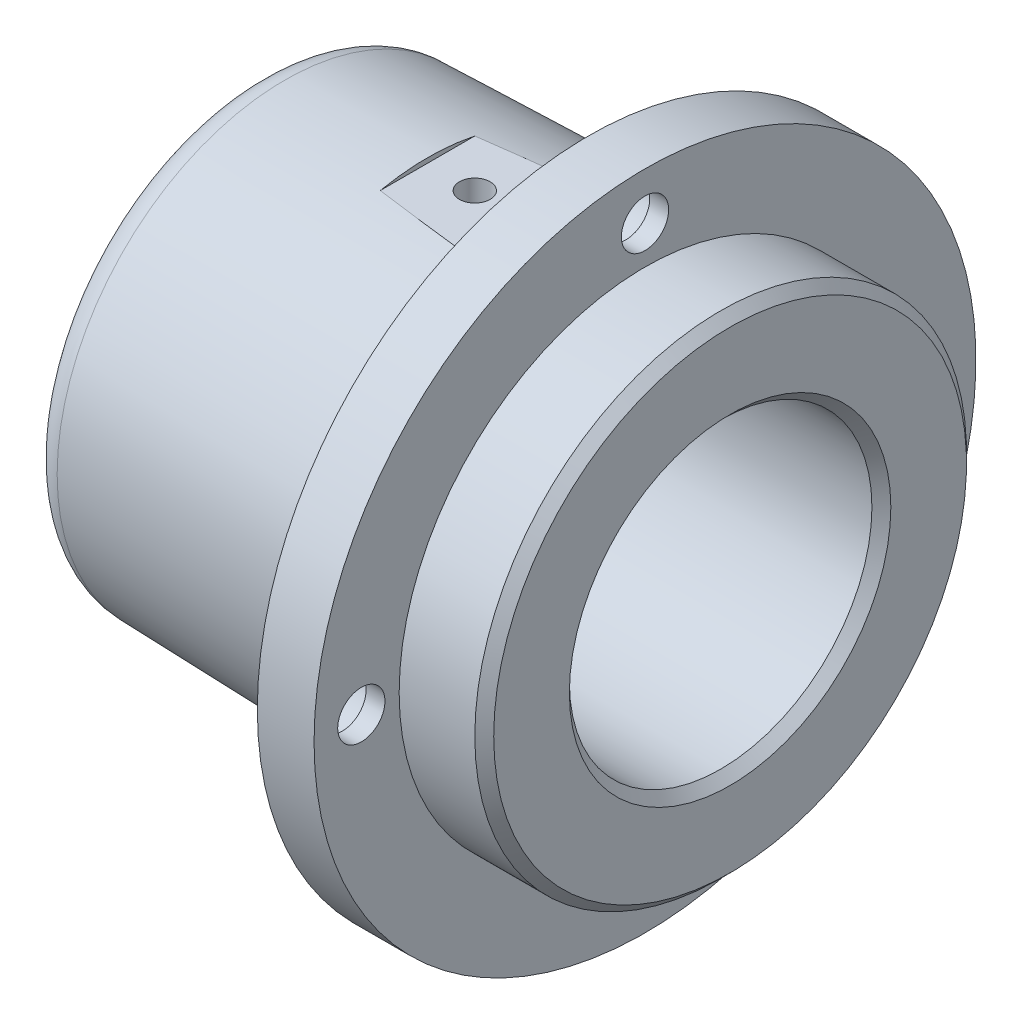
ISO-10303-21;
HEADER;
FILE_DESCRIPTION(('STEP AP214'),'2;1');
FILE_NAME('part.step','',(''),(''),'','','');
FILE_SCHEMA(('AUTOMOTIVE_DESIGN { 1 0 10303 214 1 1 1 1 }'));
ENDSEC;
DATA;
#1=APPLICATION_CONTEXT('core data for automotive mechanical design processes');
#2=APPLICATION_PROTOCOL_DEFINITION('international standard','automotive_design',2000,#1);
#3=PRODUCT_CONTEXT('',#1,'mechanical');
#4=PRODUCT('Part','Part','',(#3));
#5=PRODUCT_RELATED_PRODUCT_CATEGORY('part','',(#4));
#6=PRODUCT_DEFINITION_FORMATION('','',#4);
#7=PRODUCT_DEFINITION_CONTEXT('part definition',#1,'design');
#8=PRODUCT_DEFINITION('design','',#6,#7);
#9=PRODUCT_DEFINITION_SHAPE('','',#8);
#10=(LENGTH_UNIT() NAMED_UNIT(*) SI_UNIT(.MILLI.,.METRE.));
#11=(NAMED_UNIT(*) PLANE_ANGLE_UNIT() SI_UNIT($,.RADIAN.));
#12=(NAMED_UNIT(*) SI_UNIT($,.STERADIAN.) SOLID_ANGLE_UNIT());
#13=UNCERTAINTY_MEASURE_WITH_UNIT(LENGTH_MEASURE(1.E-05),#10,'distance_accuracy_value','');
#14=(GEOMETRIC_REPRESENTATION_CONTEXT(3) GLOBAL_UNCERTAINTY_ASSIGNED_CONTEXT((#13)) GLOBAL_UNIT_ASSIGNED_CONTEXT((#10,
#11,#12)) REPRESENTATION_CONTEXT('',''));
#15=CARTESIAN_POINT('',(0.,0.,0.));
#16=DIRECTION('',(0.,0.,1.));
#17=DIRECTION('',(1.,0.,0.));
#18=AXIS2_PLACEMENT_3D('',#15,#16,#17);
#19=CARTESIAN_POINT('',(35.,0.,0.));
#20=DIRECTION('',(1.,0.,0.));
#21=DIRECTION('',(0.,0.,-1.));
#22=AXIS2_PLACEMENT_3D('',#19,#20,#21);
#23=CONICAL_SURFACE('',#22,25.,0.0285636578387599);
#24=CARTESIAN_POINT('',(28.,0.,0.));
#25=DIRECTION('',(1.,0.,0.));
#26=DIRECTION('',(0.,0.,-1.));
#27=AXIS2_PLACEMENT_3D('',#24,#25,#26);
#28=CIRCLE('',#27,24.8);
#29=CARTESIAN_POINT('',(28.,24.,-6.24819974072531));
#30=VERTEX_POINT('',#29);
#31=CARTESIAN_POINT('',(28.,24.,6.24819974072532));
#32=VERTEX_POINT('',#31);
#33=EDGE_CURVE('E63',#30,#32,#28,.T.);
#34=ORIENTED_EDGE('',*,*,#33,.T.);
#35=CARTESIAN_POINT('',(58.5616580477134,24.,9.11661650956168));
#36=CARTESIAN_POINT('',(56.5215289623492,24.,8.95238405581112));
#37=CARTESIAN_POINT('',(54.4816889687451,24.,8.78446156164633));
#38=CARTESIAN_POINT('',(50.4026138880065,24.,8.43944149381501));
#39=CARTESIAN_POINT('',(48.3633788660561,24.,8.2623431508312));
#40=CARTESIAN_POINT('',(44.2799830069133,24.,7.89667501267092));
#41=CARTESIAN_POINT('',(42.2358249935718,24.,7.70807350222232));
#42=CARTESIAN_POINT('',(38.1489495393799,24.,7.31719920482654));
#43=CARTESIAN_POINT('',(36.1062320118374,24.,7.11492732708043));
#44=CARTESIAN_POINT('',(31.9600617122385,24.,6.68645781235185));
#45=CARTESIAN_POINT('',(29.8566643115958,24.,6.45971723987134));
#46=CARTESIAN_POINT('',(26.7035139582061,24.,6.10060335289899));
#47=CARTESIAN_POINT('',(25.6526802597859,24.,5.97771794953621));
#48=CARTESIAN_POINT('',(23.5519411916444,24.,5.72431825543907));
#49=CARTESIAN_POINT('',(22.5020358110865,24.,5.59380405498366));
#50=CARTESIAN_POINT('',(20.4049789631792,24.,5.32364431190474));
#51=CARTESIAN_POINT('',(19.3578257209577,24.,5.18401260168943));
#52=CARTESIAN_POINT('',(17.2650845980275,24.,4.8930057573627));
#53=CARTESIAN_POINT('',(16.2194967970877,24.,4.74163004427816));
#54=CARTESIAN_POINT('',(14.1310256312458,24.,4.42347278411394));
#55=CARTESIAN_POINT('',(13.0881414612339,24.,4.25669654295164));
#56=CARTESIAN_POINT('',(11.0060371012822,24.,3.90178317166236));
#57=CARTESIAN_POINT('',(9.96681649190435,24.,3.71364857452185));
#58=CARTESIAN_POINT('',(8.67481414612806,24.,3.45843101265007));
#59=CARTESIAN_POINT('',(8.41896769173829,24.,3.40684439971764));
#60=CARTESIAN_POINT('',(7.90775490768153,24.,3.30131997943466));
#61=CARTESIAN_POINT('',(7.65238858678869,24.,3.24738212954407));
#62=CARTESIAN_POINT('',(6.88696486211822,24.,3.08151823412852));
#63=CARTESIAN_POINT('',(6.37776930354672,24.,2.96557820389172));
#64=CARTESIAN_POINT('',(5.36479793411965,24.,2.71955545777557));
#65=CARTESIAN_POINT('',(4.86100879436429,24.,2.58952901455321));
#66=CARTESIAN_POINT('',(4.11006629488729,24.,2.37808316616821));
#67=CARTESIAN_POINT('',(3.8606041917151,24.,2.30488722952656));
#68=CARTESIAN_POINT('',(3.36388972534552,24.,2.1513849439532));
#69=CARTESIAN_POINT('',(3.11663702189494,24.,2.07107971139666));
#70=CARTESIAN_POINT('',(2.62024507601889,24.,1.8990988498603));
#71=CARTESIAN_POINT('',(2.37117633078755,24.,1.80721884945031));
#72=CARTESIAN_POINT('',(1.87843694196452,24.,1.6090400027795));
#73=CARTESIAN_POINT('',(1.63476900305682,24.,1.50273411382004));
#74=CARTESIAN_POINT('',(1.25453834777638,24.,1.31402768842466));
#75=CARTESIAN_POINT('',(1.11425718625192,24.,1.23916901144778));
#76=CARTESIAN_POINT('',(0.8409028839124,24.,1.07726028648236));
#77=CARTESIAN_POINT('',(0.707815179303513,24.,0.990236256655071));
#78=CARTESIAN_POINT('',(0.523284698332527,24.,0.848441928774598));
#79=CARTESIAN_POINT('',(0.466121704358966,24.,0.801190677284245));
#80=CARTESIAN_POINT('',(0.356614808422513,24.,0.701207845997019));
#81=CARTESIAN_POINT('',(0.304273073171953,24.,0.648473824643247));
#82=CARTESIAN_POINT('',(0.216510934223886,24.,0.546838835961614));
#83=CARTESIAN_POINT('',(0.179763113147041,24.,0.499102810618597));
#84=CARTESIAN_POINT('',(0.113986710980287,24.,0.398552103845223));
#85=CARTESIAN_POINT('',(0.0849369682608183,24.,0.345751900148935));
#86=CARTESIAN_POINT('',(0.0454239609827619,24.,0.252472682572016));
#87=CARTESIAN_POINT('',(0.0319900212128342,24.,0.213268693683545));
#88=CARTESIAN_POINT('',(0.0117704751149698,24.,0.13318530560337));
#89=CARTESIAN_POINT('',(0.00497561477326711,24.,0.0923083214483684));
#90=CARTESIAN_POINT('',(-0.00117529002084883,24.,0.00978855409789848));
#91=CARTESIAN_POINT('',(-0.000496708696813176,24.,-0.031856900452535));
#92=CARTESIAN_POINT('',(0.00829147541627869,24.,-0.11436208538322));
#93=CARTESIAN_POINT('',(0.0164077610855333,24.,-0.155221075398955));
#94=CARTESIAN_POINT('',(0.0416129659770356,24.,-0.243806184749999));
#95=CARTESIAN_POINT('',(0.0602780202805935,24.,-0.291075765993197));
#96=CARTESIAN_POINT('',(0.104891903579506,24.,-0.382021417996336));
#97=CARTESIAN_POINT('',(0.130856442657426,24.,-0.42568947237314));
#98=CARTESIAN_POINT('',(0.208617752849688,24.,-0.539798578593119));
#99=CARTESIAN_POINT('',(0.26550211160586,24.,-0.606718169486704));
#100=CARTESIAN_POINT('',(0.387853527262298,24.,-0.732090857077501));
#101=CARTESIAN_POINT('',(0.453347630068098,24.,-0.790515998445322));
#102=CARTESIAN_POINT('',(0.629426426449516,24.,-0.933415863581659));
#103=CARTESIAN_POINT('',(0.743900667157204,24.,-1.01303496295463));
#104=CARTESIAN_POINT('',(0.979584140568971,24.,-1.16175171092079));
#105=CARTESIAN_POINT('',(1.1008095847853,24.,-1.23082239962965));
#106=CARTESIAN_POINT('',(1.34796159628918,24.,-1.36176794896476));
#107=CARTESIAN_POINT('',(1.47391145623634,24.,-1.42359849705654));
#108=CARTESIAN_POINT('',(1.72826487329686,24.,-1.54144498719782));
#109=CARTESIAN_POINT('',(1.85666506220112,24.,-1.59746831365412));
#110=CARTESIAN_POINT('',(2.28452915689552,24.,-1.77563893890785));
#111=CARTESIAN_POINT('',(2.58790518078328,24.,-1.88834809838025));
#112=CARTESIAN_POINT('',(3.19967309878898,24.,-2.09936350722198));
#113=CARTESIAN_POINT('',(3.50806836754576,24.,-2.19765958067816));
#114=CARTESIAN_POINT('',(4.12859015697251,24.,-2.38424727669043));
#115=CARTESIAN_POINT('',(4.44072334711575,24.,-2.47251661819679));
#116=CARTESIAN_POINT('',(5.06706129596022,24.,-2.6414143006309));
#117=CARTESIAN_POINT('',(5.38126628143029,24.,-2.72204178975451));
#118=CARTESIAN_POINT('',(6.32567455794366,24.,-2.95497228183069));
#119=CARTESIAN_POINT('',(6.95805333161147,24.,-3.09843290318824));
#120=CARTESIAN_POINT('',(8.2252080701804,24.,-3.36946525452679));
#121=CARTESIAN_POINT('',(8.85997949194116,24.,-3.49705875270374));
#122=CARTESIAN_POINT('',(10.1265756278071,24.,-3.73976970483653));
#123=CARTESIAN_POINT('',(10.7583827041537,24.,-3.85497964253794));
#124=CARTESIAN_POINT('',(12.0235261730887,24.,-4.07667892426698));
#125=CARTESIAN_POINT('',(12.6568625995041,24.,-4.18316807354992));
#126=CARTESIAN_POINT('',(14.5587007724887,24.,-4.49229352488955));
#127=CARTESIAN_POINT('',(15.8288855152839,24.,-4.68456083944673));
#128=CARTESIAN_POINT('',(18.3731239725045,24.,-5.05022964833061));
#129=CARTESIAN_POINT('',(19.6471801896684,24.,-5.22361339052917));
#130=CARTESIAN_POINT('',(22.1970631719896,24.,-5.55609537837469));
#131=CARTESIAN_POINT('',(23.4728898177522,24.,-5.71519454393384));
#132=CARTESIAN_POINT('',(26.0243091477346,24.,-6.02208468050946));
#133=CARTESIAN_POINT('',(27.2999002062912,24.,-6.16988925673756));
#134=CARTESIAN_POINT('',(29.8521066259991,24.,-6.45651957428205));
#135=CARTESIAN_POINT('',(31.1287220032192,24.,-6.59534517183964));
#136=CARTESIAN_POINT('',(34.9587791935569,24.,-7.00065470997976));
#137=CARTESIAN_POINT('',(37.5133917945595,24.,-7.25608418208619));
#138=CARTESIAN_POINT('',(41.6088482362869,24.,-7.64829338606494));
#139=CARTESIAN_POINT('',(43.1490524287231,24.,-7.79187959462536));
#140=CARTESIAN_POINT('',(46.2302159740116,24.,-8.07241725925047));
#141=CARTESIAN_POINT('',(47.771175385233,24.,-8.20936807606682));
#142=CARTESIAN_POINT('',(50.8535636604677,24.,-8.47756833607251));
#143=CARTESIAN_POINT('',(52.3949925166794,24.,-8.60881786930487));
#144=CARTESIAN_POINT('',(55.4781098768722,24.,-8.86630100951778));
#145=CARTESIAN_POINT('',(57.0197983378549,24.,-8.99253513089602));
#146=CARTESIAN_POINT('',(58.5616580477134,24.,-9.11661650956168));
#147=B_SPLINE_CURVE_WITH_KNOTS('',3,(#35,#36,#37,#38,#39,#40,#41,#42,#43,#44,#45,#46,#47,#48,
#49,#50,#51,#52,#53,#54,#55,#56,#57,#58,#59,#60,#61,#62,#63,#64,#65,#66,#67,#68,#69,#70,#71,#72,
#73,#74,#75,#76,#77,#78,#79,#80,#81,#82,#83,#84,#85,#86,#87,#88,#89,#90,#91,#92,#93,#94,#95,#96,
#97,#98,#99,#100,#101,#102,#103,#104,#105,#106,#107,#108,#109,#110,#111,#112,#113,#114,#115,
#116,#117,#118,#119,#120,#121,#122,#123,#124,#125,#126,#127,#128,#129,#130,#131,#132,#133,#134,
#135,#136,#137,#138,#139,#140,#141,#142,#143,#144,#145,#146),.UNSPECIFIED.,.F.,.F.,(4,2,2,2,2,2,
2,2,2,2,2,2,2,2,2,2,2,2,2,2,2,2,2,2,2,2,2,2,2,2,2,2,2,2,2,2,2,2,2,2,2,2,2,2,2,2,2,2,2,2,2,2,2,2,
2,4),(0.,6.14019483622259,12.2809053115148,18.4393870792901,24.597459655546,30.9440794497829,
34.1180416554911,37.2919663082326,40.4611828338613,43.6305556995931,46.7988406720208,
49.9667502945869,50.7497273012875,51.5327184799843,53.0992710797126,54.659781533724,
55.4396463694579,56.2193889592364,57.0156045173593,57.8122101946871,58.2889383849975,
58.7646621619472,58.9869217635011,59.2092807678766,59.3895356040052,59.5692896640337,
59.6931399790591,59.8168174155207,59.9410681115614,60.0654305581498,60.2170374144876,
60.3689730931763,60.6309742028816,60.8938189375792,61.3110476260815,61.7293254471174,
62.1500425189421,62.5702178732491,63.5404002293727,64.5112642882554,65.4842452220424,
66.4573344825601,68.4023211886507,70.344609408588,72.2712025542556,74.197838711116,
78.0515560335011,81.9088654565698,85.765926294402,89.6182652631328,93.4706658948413,
101.172568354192,105.813207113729,110.45429206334,115.09530368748,119.735838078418),.UNSPECIFIED.);
#148=CARTESIAN_POINT('',(18.,24.,4.99501792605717));
#149=VERTEX_POINT('',#148);
#150=EDGE_CURVE('E11',#32,#149,#147,.T.);
#151=ORIENTED_EDGE('',*,*,#150,.T.);
#152=CARTESIAN_POINT('',(18.,0.,0.));
#153=DIRECTION('',(-1.,0.,0.));
#154=DIRECTION('',(0.,0.,1.));
#155=AXIS2_PLACEMENT_3D('',#152,#153,#154);
#156=CIRCLE('',#155,24.5142857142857);
#157=CARTESIAN_POINT('',(18.,24.,-4.99501792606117));
#158=VERTEX_POINT('',#157);
#159=EDGE_CURVE('E35',#149,#158,#156,.T.);
#160=ORIENTED_EDGE('',*,*,#159,.T.);
#161=EDGE_CURVE('E41',#158,#30,#147,.T.);
#162=ORIENTED_EDGE('',*,*,#161,.T.);
#163=EDGE_LOOP('',(#34,#151,#160,#162));
#164=FACE_BOUND('',#163,.T.);
#165=CARTESIAN_POINT('',(34.0285597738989,0.,0.));
#166=DIRECTION('',(1.,0.,0.));
#167=DIRECTION('',(0.,0.,-1.));
#168=AXIS2_PLACEMENT_3D('',#165,#166,#167);
#169=CIRCLE('',#168,24.9722445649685);
#170=CARTESIAN_POINT('',(34.0285597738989,0.,-24.9722445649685));
#171=VERTEX_POINT('',#170);
#172=EDGE_CURVE('E219',#171,#171,#169,.F.);
#173=ORIENTED_EDGE('',*,*,#172,.T.);
#174=EDGE_LOOP('',(#173));
#175=FACE_BOUND('',#174,.T.);
#176=CARTESIAN_POINT('',(2.91432067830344,0.,0.));
#177=DIRECTION('',(-1.,0.,0.));
#178=DIRECTION('',(0.,0.,1.));
#179=AXIS2_PLACEMENT_3D('',#176,#177,#178);
#180=CIRCLE('',#179,24.0832663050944);
#181=CARTESIAN_POINT('',(2.91432067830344,0.,24.0832663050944));
#182=VERTEX_POINT('',#181);
#183=EDGE_CURVE('E210',#182,#182,#180,.F.);
#184=ORIENTED_EDGE('',*,*,#183,.T.);
#185=EDGE_LOOP('',(#184));
#186=FACE_BOUND('',#185,.T.);
#187=ADVANCED_FACE('F31',(#164,#175,#186),#23,.T.);
#188=CARTESIAN_POINT('',(35.,25.,0.));
#189=DIRECTION('',(1.,0.,0.));
#190=DIRECTION('',(0.,0.,-1.));
#191=AXIS2_PLACEMENT_3D('',#188,#189,#190);
#192=PLANE('',#191);
#193=CARTESIAN_POINT('',(35.,3.14233502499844E-13,-30.));
#194=DIRECTION('',(-1.,0.,0.));
#195=DIRECTION('',(0.,1.,0.));
#196=AXIS2_PLACEMENT_3D('',#193,#194,#195);
#197=CIRCLE('',#196,4.);
#198=CARTESIAN_POINT('',(35.,4.00000000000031,-30.));
#199=VERTEX_POINT('',#198);
#200=EDGE_CURVE('E186',#199,#199,#197,.T.);
#201=ORIENTED_EDGE('',*,*,#200,.F.);
#202=EDGE_LOOP('',(#201));
#203=FACE_BOUND('',#202,.T.);
#204=CARTESIAN_POINT('',(35.,-30.,-2.09489001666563E-13));
#205=DIRECTION('',(-1.,0.,0.));
#206=DIRECTION('',(0.,0.,-1.));
#207=AXIS2_PLACEMENT_3D('',#204,#205,#206);
#208=CIRCLE('',#207,4.);
#209=CARTESIAN_POINT('',(35.,-30.,-4.00000000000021));
#210=VERTEX_POINT('',#209);
#211=EDGE_CURVE('E190',#210,#210,#208,.T.);
#212=ORIENTED_EDGE('',*,*,#211,.F.);
#213=EDGE_LOOP('',(#212));
#214=FACE_BOUND('',#213,.T.);
#215=CARTESIAN_POINT('',(35.,-1.04744500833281E-13,30.));
#216=DIRECTION('',(-1.,0.,0.));
#217=DIRECTION('',(0.,-1.,0.));
#218=AXIS2_PLACEMENT_3D('',#215,#216,#217);
#219=CIRCLE('',#218,4.);
#220=CARTESIAN_POINT('',(35.,-4.0000000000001,30.));
#221=VERTEX_POINT('',#220);
#222=EDGE_CURVE('E194',#221,#221,#219,.T.);
#223=ORIENTED_EDGE('',*,*,#222,.F.);
#224=EDGE_LOOP('',(#223));
#225=FACE_BOUND('',#224,.T.);
#226=CARTESIAN_POINT('',(35.,30.,0.));
#227=DIRECTION('',(-1.,0.,0.));
#228=DIRECTION('',(0.,0.,1.));
#229=AXIS2_PLACEMENT_3D('',#226,#227,#228);
#230=CIRCLE('',#229,4.);
#231=CARTESIAN_POINT('',(35.,30.,4.));
#232=VERTEX_POINT('',#231);
#233=EDGE_CURVE('E198',#232,#232,#230,.T.);
#234=ORIENTED_EDGE('',*,*,#233,.F.);
#235=EDGE_LOOP('',(#234));
#236=FACE_BOUND('',#235,.T.);
#237=CARTESIAN_POINT('',(35.,0.,0.));
#238=DIRECTION('',(1.,0.,0.));
#239=DIRECTION('',(0.,0.,-1.));
#240=AXIS2_PLACEMENT_3D('',#237,#238,#239);
#241=CIRCLE('',#240,25.9718366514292);
#242=CARTESIAN_POINT('',(35.,0.,-25.9718366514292));
#243=VERTEX_POINT('',#242);
#244=EDGE_CURVE('E202',#243,#243,#241,.T.);
#245=ORIENTED_EDGE('',*,*,#244,.T.);
#246=EDGE_LOOP('',(#245));
#247=FACE_BOUND('',#246,.T.);
#248=CARTESIAN_POINT('',(35.,0.,0.));
#249=DIRECTION('',(-1.,0.,0.));
#250=DIRECTION('',(0.,0.,1.));
#251=AXIS2_PLACEMENT_3D('',#248,#249,#250);
#252=CIRCLE('',#251,35.);
#253=CARTESIAN_POINT('',(35.,0.,35.));
#254=VERTEX_POINT('',#253);
#255=EDGE_CURVE('E205',#254,#254,#252,.T.);
#256=ORIENTED_EDGE('',*,*,#255,.T.);
#257=EDGE_LOOP('',(#256));
#258=FACE_BOUND('',#257,.T.);
#259=ADVANCED_FACE('F176',(#203,#214,#225,#236,#247,#258),#192,.F.);
#260=CARTESIAN_POINT('',(-12.3083700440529,0.,0.));
#261=DIRECTION('',(-1.,0.,0.));
#262=DIRECTION('',(0.,0.,1.));
#263=AXIS2_PLACEMENT_3D('',#260,#261,#262);
#264=CYLINDRICAL_SURFACE('',#263,35.);
#265=ORIENTED_EDGE('',*,*,#255,.F.);
#266=EDGE_LOOP('',(#265));
#267=FACE_BOUND('',#266,.T.);
#268=CARTESIAN_POINT('',(41.,0.,0.));
#269=DIRECTION('',(-1.,0.,0.));
#270=DIRECTION('',(0.,0.,1.));
#271=AXIS2_PLACEMENT_3D('',#268,#269,#270);
#272=CIRCLE('',#271,35.);
#273=CARTESIAN_POINT('',(41.,0.,35.));
#274=VERTEX_POINT('',#273);
#275=EDGE_CURVE('E207',#274,#274,#272,.T.);
#276=ORIENTED_EDGE('',*,*,#275,.T.);
#277=EDGE_LOOP('',(#276));
#278=FACE_BOUND('',#277,.T.);
#279=ADVANCED_FACE('F173',(#267,#278),#264,.T.);
#280=CARTESIAN_POINT('',(41.,35.,0.));
#281=DIRECTION('',(-1.,0.,0.));
#282=DIRECTION('',(0.,0.,1.));
#283=AXIS2_PLACEMENT_3D('',#280,#281,#282);
#284=PLANE('',#283);
#285=CARTESIAN_POINT('',(41.,3.14233502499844E-13,-30.));
#286=DIRECTION('',(-1.,0.,0.));
#287=DIRECTION('',(0.,0.,1.));
#288=AXIS2_PLACEMENT_3D('',#285,#286,#287);
#289=CIRCLE('',#288,2.5);
#290=CARTESIAN_POINT('',(41.,3.14233502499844E-13,-27.5));
#291=VERTEX_POINT('',#290);
#292=EDGE_CURVE('E291',#291,#291,#289,.T.);
#293=ORIENTED_EDGE('',*,*,#292,.T.);
#294=EDGE_LOOP('',(#293));
#295=FACE_BOUND('',#294,.T.);
#296=CARTESIAN_POINT('',(41.,-30.,-2.09489001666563E-13));
#297=DIRECTION('',(-1.,0.,0.));
#298=DIRECTION('',(0.,0.,1.));
#299=AXIS2_PLACEMENT_3D('',#296,#297,#298);
#300=CIRCLE('',#299,2.5);
#301=CARTESIAN_POINT('',(41.,-30.,2.49999999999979));
#302=VERTEX_POINT('',#301);
#303=EDGE_CURVE('E285',#302,#302,#300,.T.);
#304=ORIENTED_EDGE('',*,*,#303,.T.);
#305=EDGE_LOOP('',(#304));
#306=FACE_BOUND('',#305,.T.);
#307=CARTESIAN_POINT('',(41.,-1.04744500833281E-13,30.));
#308=DIRECTION('',(-1.,0.,0.));
#309=DIRECTION('',(0.,0.,1.));
#310=AXIS2_PLACEMENT_3D('',#307,#308,#309);
#311=CIRCLE('',#310,2.5);
#312=CARTESIAN_POINT('',(41.,-1.04744500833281E-13,32.5));
#313=VERTEX_POINT('',#312);
#314=EDGE_CURVE('E279',#313,#313,#311,.T.);
#315=ORIENTED_EDGE('',*,*,#314,.T.);
#316=EDGE_LOOP('',(#315));
#317=FACE_BOUND('',#316,.T.);
#318=CARTESIAN_POINT('',(41.,30.,0.));
#319=DIRECTION('',(-1.,0.,0.));
#320=DIRECTION('',(0.,0.,1.));
#321=AXIS2_PLACEMENT_3D('',#318,#319,#320);
#322=CIRCLE('',#321,2.5);
#323=CARTESIAN_POINT('',(41.,30.,2.5));
#324=VERTEX_POINT('',#323);
#325=EDGE_CURVE('E261',#324,#324,#322,.T.);
#326=ORIENTED_EDGE('',*,*,#325,.T.);
#327=EDGE_LOOP('',(#326));
#328=FACE_BOUND('',#327,.T.);
#329=ORIENTED_EDGE('',*,*,#275,.F.);
#330=EDGE_LOOP('',(#329));
#331=FACE_BOUND('',#330,.T.);
#332=CARTESIAN_POINT('',(41.,0.,0.));
#333=DIRECTION('',(-1.,0.,0.));
#334=DIRECTION('',(0.,0.,1.));
#335=AXIS2_PLACEMENT_3D('',#332,#333,#334);
#336=CIRCLE('',#335,26.);
#337=CARTESIAN_POINT('',(41.,0.,26.));
#338=VERTEX_POINT('',#337);
#339=EDGE_CURVE('E213',#338,#338,#336,.T.);
#340=ORIENTED_EDGE('',*,*,#339,.T.);
#341=EDGE_LOOP('',(#340));
#342=FACE_BOUND('',#341,.T.);
#343=ADVANCED_FACE('F169',(#295,#306,#317,#328,#331,#342),#284,.F.);
#344=CARTESIAN_POINT('',(-12.3083700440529,0.,0.));
#345=DIRECTION('',(-1.,0.,0.));
#346=DIRECTION('',(0.,0.,1.));
#347=AXIS2_PLACEMENT_3D('',#344,#345,#346);
#348=CYLINDRICAL_SURFACE('',#347,26.);
#349=CARTESIAN_POINT('',(49.,0.,0.));
#350=DIRECTION('',(-1.,0.,0.));
#351=DIRECTION('',(0.,0.,1.));
#352=AXIS2_PLACEMENT_3D('',#349,#350,#351);
#353=CIRCLE('',#352,26.);
#354=CARTESIAN_POINT('',(49.,0.,26.));
#355=VERTEX_POINT('',#354);
#356=EDGE_CURVE('E223',#355,#355,#353,.T.);
#357=ORIENTED_EDGE('',*,*,#356,.T.);
#358=EDGE_LOOP('',(#357));
#359=FACE_BOUND('',#358,.T.);
#360=ORIENTED_EDGE('',*,*,#339,.F.);
#361=EDGE_LOOP('',(#360));
#362=FACE_BOUND('',#361,.T.);
#363=ADVANCED_FACE('F165',(#359,#362),#348,.T.);
#364=CARTESIAN_POINT('',(50.,26.,0.));
#365=DIRECTION('',(-1.,0.,0.));
#366=DIRECTION('',(0.,0.,1.));
#367=AXIS2_PLACEMENT_3D('',#364,#365,#366);
#368=PLANE('',#367);
#369=CARTESIAN_POINT('',(50.,0.,0.));
#370=DIRECTION('',(-1.,0.,0.));
#371=DIRECTION('',(0.,0.,1.));
#372=AXIS2_PLACEMENT_3D('',#369,#370,#371);
#373=CIRCLE('',#372,25.);
#374=CARTESIAN_POINT('',(50.,0.,25.));
#375=VERTEX_POINT('',#374);
#376=EDGE_CURVE('E229',#375,#375,#373,.F.);
#377=ORIENTED_EDGE('',*,*,#376,.T.);
#378=EDGE_LOOP('',(#377));
#379=FACE_BOUND('',#378,.T.);
#380=CARTESIAN_POINT('',(50.,0.,0.));
#381=DIRECTION('',(-1.,0.,0.));
#382=DIRECTION('',(0.,0.,1.));
#383=AXIS2_PLACEMENT_3D('',#380,#381,#382);
#384=CIRCLE('',#383,17.);
#385=CARTESIAN_POINT('',(50.,0.,17.));
#386=VERTEX_POINT('',#385);
#387=EDGE_CURVE('E226',#386,#386,#384,.T.);
#388=ORIENTED_EDGE('',*,*,#387,.T.);
#389=EDGE_LOOP('',(#388));
#390=FACE_BOUND('',#389,.T.);
#391=ADVANCED_FACE('F161',(#379,#390),#368,.F.);
#392=CARTESIAN_POINT('',(-12.3083700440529,0.,0.));
#393=DIRECTION('',(-1.,0.,0.));
#394=DIRECTION('',(0.,0.,1.));
#395=AXIS2_PLACEMENT_3D('',#392,#393,#394);
#396=CYLINDRICAL_SURFACE('',#395,16.);
#397=CARTESIAN_POINT('',(23.,15.9175725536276,1.622));
#398=CARTESIAN_POINT('',(22.909143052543,15.9175736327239,1.62199606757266));
#399=CARTESIAN_POINT('',(22.818226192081,15.9183588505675,1.61434020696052));
#400=CARTESIAN_POINT('',(22.6389136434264,15.9214144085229,1.58391539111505));
#401=CARTESIAN_POINT('',(22.5505208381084,15.9236863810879,1.56112982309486));
#402=CARTESIAN_POINT('',(22.3788790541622,15.9294555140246,1.50111631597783));
#403=CARTESIAN_POINT('',(22.2956269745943,15.9329519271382,1.46389718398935));
#404=CARTESIAN_POINT('',(22.1365693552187,15.9407750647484,1.37609007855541));
#405=CARTESIAN_POINT('',(22.0607623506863,15.9451016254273,1.32550474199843));
#406=CARTESIAN_POINT('',(21.9184459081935,15.9541156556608,1.21219831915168));
#407=CARTESIAN_POINT('',(21.8519681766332,15.9588042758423,1.14943749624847));
#408=CARTESIAN_POINT('',(21.7304704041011,15.9680036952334,1.01364659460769));
#409=CARTESIAN_POINT('',(21.6754508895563,15.9725144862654,0.94061604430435));
#410=CARTESIAN_POINT('',(21.5783215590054,15.9808613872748,0.786164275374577));
#411=CARTESIAN_POINT('',(21.5362398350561,15.984696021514,0.70472530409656));
#412=CARTESIAN_POINT('',(21.4663603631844,15.9912460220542,0.535891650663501));
#413=CARTESIAN_POINT('',(21.4385622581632,15.9939614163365,0.448497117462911));
#414=CARTESIAN_POINT('',(21.3981321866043,15.9979589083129,0.270553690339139));
#415=CARTESIAN_POINT('',(21.385448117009,15.9992459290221,0.18001674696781));
#416=CARTESIAN_POINT('',(21.3754449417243,16.0002584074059,-0.00190941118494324));
#417=CARTESIAN_POINT('',(21.3781254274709,15.9999839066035,-0.093298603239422));
#418=CARTESIAN_POINT('',(21.3987330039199,15.9979082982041,-0.273981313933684));
#419=CARTESIAN_POINT('',(21.4166040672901,15.9961128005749,-0.363281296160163));
#420=CARTESIAN_POINT('',(21.4669982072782,15.9912034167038,-0.537607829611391));
#421=CARTESIAN_POINT('',(21.4995214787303,15.9880895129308,-0.622634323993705));
#422=CARTESIAN_POINT('',(21.5783581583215,15.9808837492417,-0.786176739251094));
#423=CARTESIAN_POINT('',(21.6246963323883,15.9767901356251,-0.864680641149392));
#424=CARTESIAN_POINT('',(21.729829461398,15.9680842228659,-1.01281828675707));
#425=CARTESIAN_POINT('',(21.788624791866,15.9634719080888,-1.08245176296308));
#426=CARTESIAN_POINT('',(21.9173182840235,15.9542216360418,-1.21120012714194));
#427=CARTESIAN_POINT('',(21.9872651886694,15.9495836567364,-1.27026630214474));
#428=CARTESIAN_POINT('',(22.136107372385,15.9408254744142,-1.37582618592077));
#429=CARTESIAN_POINT('',(22.215002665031,15.9367052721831,-1.42231987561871));
#430=CARTESIAN_POINT('',(22.3795398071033,15.9294487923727,-1.50141491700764));
#431=CARTESIAN_POINT('',(22.4651831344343,15.9263127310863,-1.53401321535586));
#432=CARTESIAN_POINT('',(22.6407665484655,15.9213840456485,-1.58435334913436));
#433=CARTESIAN_POINT('',(22.7307065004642,15.9195913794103,-1.60209564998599));
#434=CARTESIAN_POINT('',(22.9119023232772,15.9175597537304,-1.62215739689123));
#435=CARTESIAN_POINT('',(23.0031505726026,15.9173139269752,-1.62454501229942));
#436=CARTESIAN_POINT('',(23.1847482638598,15.9183856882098,-1.61400868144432));
#437=CARTESIAN_POINT('',(23.2750977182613,15.919703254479,-1.60108494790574));
#438=CARTESIAN_POINT('',(23.4521341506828,15.9237470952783,-1.56034982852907));
#439=CARTESIAN_POINT('',(23.5388286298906,15.9264703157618,-1.53257071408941));
#440=CARTESIAN_POINT('',(23.70632741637,15.933016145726,-1.46294633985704));
#441=CARTESIAN_POINT('',(23.7871315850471,15.9368387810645,-1.42110074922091));
#442=CARTESIAN_POINT('',(23.9408666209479,15.9451693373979,-1.32436065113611));
#443=CARTESIAN_POINT('',(24.0137689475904,15.9496796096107,-1.26942099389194));
#444=CARTESIAN_POINT('',(24.1493413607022,15.9588695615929,-1.14811696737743));
#445=CARTESIAN_POINT('',(24.212011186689,15.9635492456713,-1.08175230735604));
#446=CARTESIAN_POINT('',(24.325574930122,15.9725714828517,-0.939186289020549));
#447=CARTESIAN_POINT('',(24.3764243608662,15.9769127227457,-0.862949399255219));
#448=CARTESIAN_POINT('',(24.4645976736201,15.9847497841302,-0.70297837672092));
#449=CARTESIAN_POINT('',(24.5019217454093,15.9882456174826,-0.619244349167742));
#450=CARTESIAN_POINT('',(24.5619095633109,15.9939920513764,-0.446810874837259));
#451=CARTESIAN_POINT('',(24.5846001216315,15.9962449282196,-0.358120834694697));
#452=CARTESIAN_POINT('',(24.6147643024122,15.9992609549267,-0.178165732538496));
#453=CARTESIAN_POINT('',(24.6222383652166,16.0000241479,-0.0869007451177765));
#454=CARTESIAN_POINT('',(24.621751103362,15.9999747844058,0.095176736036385));
#455=CARTESIAN_POINT('',(24.6138588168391,15.9991692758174,0.185989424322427));
#456=CARTESIAN_POINT('',(24.583007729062,15.9960869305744,0.364991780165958));
#457=CARTESIAN_POINT('',(24.5600489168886,15.9938100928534,0.453181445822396));
#458=CARTESIAN_POINT('',(24.4997357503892,15.9880401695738,0.624433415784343));
#459=CARTESIAN_POINT('',(24.4623834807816,15.9845472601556,0.707496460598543));
#460=CARTESIAN_POINT('',(24.3743510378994,15.9767344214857,0.866184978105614));
#461=CARTESIAN_POINT('',(24.3236709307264,15.9724144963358,0.941810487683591));
#462=CARTESIAN_POINT('',(24.2101626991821,15.9634082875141,1.08383096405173));
#463=CARTESIAN_POINT('',(24.1472831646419,15.9587205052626,1.15018474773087));
#464=CARTESIAN_POINT('',(24.0112627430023,15.9495195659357,1.27142949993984));
#465=CARTESIAN_POINT('',(23.9381193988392,15.945006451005,1.32631771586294));
#466=CARTESIAN_POINT('',(23.7834384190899,15.9366532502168,1.42318673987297));
#467=CARTESIAN_POINT('',(23.7018794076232,15.9328149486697,1.46513354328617));
#468=CARTESIAN_POINT('',(23.5328883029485,15.9262671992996,1.53468057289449));
#469=CARTESIAN_POINT('',(23.4454629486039,15.9235564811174,1.56229695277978));
#470=CARTESIAN_POINT('',(23.2979538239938,15.9202531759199,1.59552599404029));
#471=CARTESIAN_POINT('',(23.2388125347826,15.9192527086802,1.60544014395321));
#472=CARTESIAN_POINT('',(23.1197895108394,15.9179120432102,1.61867842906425));
#473=CARTESIAN_POINT('',(23.0599077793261,15.9175718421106,1.62200259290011));
#474=CARTESIAN_POINT('',(23.,15.9175725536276,1.622));
#475=B_SPLINE_CURVE_WITH_KNOTS('',3,(#397,#398,#399,#400,#401,#402,#403,#404,#405,#406,#407,
#408,#409,#410,#411,#412,#413,#414,#415,#416,#417,#418,#419,#420,#421,#422,#423,#424,#425,#426,
#427,#428,#429,#430,#431,#432,#433,#434,#435,#436,#437,#438,#439,#440,#441,#442,#443,#444,#445,
#446,#447,#448,#449,#450,#451,#452,#453,#454,#455,#456,#457,#458,#459,#460,#461,#462,#463,#464,
#465,#466,#467,#468,#469,#470,#471,#472,#473,#474),.UNSPECIFIED.,.T.,.F.,(4,2,2,2,2,2,2,2,2,2,2,
2,2,2,2,2,2,2,2,2,2,2,2,2,2,2,2,2,2,2,2,2,2,2,2,2,2,2,4),(0.,0.272352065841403,
0.545003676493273,0.817489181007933,1.08992096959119,1.3632573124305,1.63660621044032,
1.91054451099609,2.1844759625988,2.45746032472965,2.73043742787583,3.00241205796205,
3.2743903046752,3.5468590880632,3.8193360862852,4.09303847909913,4.36674128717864,
4.64050420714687,4.91425855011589,5.18679667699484,5.45933101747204,5.73127570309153,
6.00322678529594,6.27612950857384,6.54903917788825,6.82295990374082,7.09687678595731,
7.37029034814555,7.64369599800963,7.91587612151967,8.18805644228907,8.46019735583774,
8.73233691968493,9.00564925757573,9.2790271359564,9.55311733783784,9.82689790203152,
10.0064777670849,10.186056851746),.UNSPECIFIED.);
#476=CARTESIAN_POINT('',(23.,15.9175725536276,1.622));
#477=VERTEX_POINT('',#476);
#478=EDGE_CURVE('E300',#477,#477,#475,.T.);
#479=ORIENTED_EDGE('',*,*,#478,.F.);
#480=EDGE_LOOP('',(#479));
#481=FACE_BOUND('',#480,.T.);
#482=CARTESIAN_POINT('',(1.00000000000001,0.,0.));
#483=DIRECTION('',(1.,0.,0.));
#484=DIRECTION('',(0.,0.,-1.));
#485=AXIS2_PLACEMENT_3D('',#482,#483,#484);
#486=CIRCLE('',#485,16.);
#487=CARTESIAN_POINT('',(1.00000000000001,0.,-16.));
#488=VERTEX_POINT('',#487);
#489=EDGE_CURVE('E234',#488,#488,#486,.F.);
#490=ORIENTED_EDGE('',*,*,#489,.T.);
#491=EDGE_LOOP('',(#490));
#492=FACE_BOUND('',#491,.T.);
#493=CARTESIAN_POINT('',(49.,0.,0.));
#494=DIRECTION('',(-1.,0.,0.));
#495=DIRECTION('',(0.,0.,1.));
#496=AXIS2_PLACEMENT_3D('',#493,#494,#495);
#497=CIRCLE('',#496,16.);
#498=CARTESIAN_POINT('',(49.,0.,16.));
#499=VERTEX_POINT('',#498);
#500=EDGE_CURVE('E232',#499,#499,#497,.F.);
#501=ORIENTED_EDGE('',*,*,#500,.T.);
#502=EDGE_LOOP('',(#501));
#503=FACE_BOUND('',#502,.T.);
#504=ADVANCED_FACE('F157',(#481,#492,#503),#396,.F.);
#505=CARTESIAN_POINT('',(0.,16.,0.));
#506=DIRECTION('',(1.,0.,0.));
#507=DIRECTION('',(0.,0.,-1.));
#508=AXIS2_PLACEMENT_3D('',#505,#506,#507);
#509=PLANE('',#508);
#510=CARTESIAN_POINT('',(0.,0.,0.));
#511=DIRECTION('',(1.,0.,0.));
#512=DIRECTION('',(0.,0.,-1.));
#513=AXIS2_PLACEMENT_3D('',#510,#511,#512);
#514=CIRCLE('',#513,17.);
#515=CARTESIAN_POINT('',(0.,0.,-17.));
#516=VERTEX_POINT('',#515);
#517=EDGE_CURVE('E64',#516,#516,#514,.T.);
#518=ORIENTED_EDGE('',*,*,#517,.T.);
#519=EDGE_LOOP('',(#518));
#520=FACE_BOUND('',#519,.T.);
#521=CARTESIAN_POINT('',(0.,0.,0.));
#522=DIRECTION('',(1.,0.,0.));
#523=DIRECTION('',(0.,0.,-1.));
#524=AXIS2_PLACEMENT_3D('',#521,#522,#523);
#525=CIRCLE('',#524,21.0844900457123);
#526=CARTESIAN_POINT('',(0.,0.,-21.0844900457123));
#527=VERTEX_POINT('',#526);
#528=EDGE_CURVE('E206',#527,#527,#525,.F.);
#529=ORIENTED_EDGE('',*,*,#528,.T.);
#530=EDGE_LOOP('',(#529));
#531=FACE_BOUND('',#530,.T.);
#532=ADVANCED_FACE('F153',(#520,#531),#509,.F.);
#533=CARTESIAN_POINT('',(3.,0.,0.));
#534=DIRECTION('',(1.,0.,0.));
#535=DIRECTION('',(0.,0.,-1.));
#536=AXIS2_PLACEMENT_3D('',#533,#534,#535);
#537=TOROIDAL_SURFACE('',#536,21.0844900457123,3.);
#538=ORIENTED_EDGE('',*,*,#183,.F.);
#539=EDGE_LOOP('',(#538));
#540=FACE_BOUND('',#539,.T.);
#541=ORIENTED_EDGE('',*,*,#528,.F.);
#542=EDGE_LOOP('',(#541));
#543=FACE_BOUND('',#542,.T.);
#544=ADVANCED_FACE('F149',(#540,#543),#537,.T.);
#545=CARTESIAN_POINT('',(34.,0.,0.));
#546=DIRECTION('',(1.,0.,0.));
#547=DIRECTION('',(0.,0.,-1.));
#548=AXIS2_PLACEMENT_3D('',#545,#546,#547);
#549=TOROIDAL_SURFACE('',#548,25.9718366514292,1.);
#550=ORIENTED_EDGE('',*,*,#244,.F.);
#551=EDGE_LOOP('',(#550));
#552=FACE_BOUND('',#551,.T.);
#553=ORIENTED_EDGE('',*,*,#172,.F.);
#554=EDGE_LOOP('',(#553));
#555=FACE_BOUND('',#554,.T.);
#556=ADVANCED_FACE('F145',(#552,#555),#549,.F.);
#557=CARTESIAN_POINT('',(49.,0.,0.));
#558=DIRECTION('',(-1.,0.,0.));
#559=DIRECTION('',(0.,0.,1.));
#560=AXIS2_PLACEMENT_3D('',#557,#558,#559);
#561=CONICAL_SURFACE('',#560,26.,0.785398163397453);
#562=ORIENTED_EDGE('',*,*,#376,.F.);
#563=EDGE_LOOP('',(#562));
#564=FACE_BOUND('',#563,.T.);
#565=ORIENTED_EDGE('',*,*,#356,.F.);
#566=EDGE_LOOP('',(#565));
#567=FACE_BOUND('',#566,.T.);
#568=ADVANCED_FACE('F141',(#564,#567),#561,.T.);
#569=CARTESIAN_POINT('',(1.00000000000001,0.,0.));
#570=DIRECTION('',(-1.,0.,0.));
#571=DIRECTION('',(0.,0.,1.));
#572=AXIS2_PLACEMENT_3D('',#569,#570,#571);
#573=CONICAL_SURFACE('',#572,16.,0.785398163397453);
#574=ORIENTED_EDGE('',*,*,#517,.F.);
#575=EDGE_LOOP('',(#574));
#576=FACE_BOUND('',#575,.T.);
#577=ORIENTED_EDGE('',*,*,#489,.F.);
#578=EDGE_LOOP('',(#577));
#579=FACE_BOUND('',#578,.T.);
#580=ADVANCED_FACE('F137',(#576,#579),#573,.F.);
#581=CARTESIAN_POINT('',(50.,0.,0.));
#582=DIRECTION('',(1.,0.,0.));
#583=DIRECTION('',(0.,0.,-1.));
#584=AXIS2_PLACEMENT_3D('',#581,#582,#583);
#585=CONICAL_SURFACE('',#584,17.,0.785398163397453);
#586=ORIENTED_EDGE('',*,*,#500,.F.);
#587=EDGE_LOOP('',(#586));
#588=FACE_BOUND('',#587,.T.);
#589=ORIENTED_EDGE('',*,*,#387,.F.);
#590=EDGE_LOOP('',(#589));
#591=FACE_BOUND('',#590,.T.);
#592=ADVANCED_FACE('F133',(#588,#591),#585,.F.);
#593=CARTESIAN_POINT('',(39.,30.,0.));
#594=DIRECTION('',(-1.,0.,0.));
#595=DIRECTION('',(0.,0.,1.));
#596=AXIS2_PLACEMENT_3D('',#593,#594,#595);
#597=CYLINDRICAL_SURFACE('',#596,4.);
#598=CARTESIAN_POINT('',(39.,30.,0.));
#599=DIRECTION('',(-1.,0.,0.));
#600=DIRECTION('',(0.,0.,1.));
#601=AXIS2_PLACEMENT_3D('',#598,#599,#600);
#602=CIRCLE('',#601,4.);
#603=CARTESIAN_POINT('',(39.,30.,4.));
#604=VERTEX_POINT('',#603);
#605=EDGE_CURVE('E256',#604,#604,#602,.T.);
#606=ORIENTED_EDGE('',*,*,#605,.F.);
#607=EDGE_LOOP('',(#606));
#608=FACE_BOUND('',#607,.T.);
#609=ORIENTED_EDGE('',*,*,#233,.T.);
#610=EDGE_LOOP('',(#609));
#611=FACE_BOUND('',#610,.T.);
#612=ADVANCED_FACE('F129',(#608,#611),#597,.F.);
#613=CARTESIAN_POINT('',(39.,30.,0.));
#614=DIRECTION('',(-1.,0.,0.));
#615=DIRECTION('',(0.,0.,1.));
#616=AXIS2_PLACEMENT_3D('',#613,#614,#615);
#617=PLANE('',#616);
#618=CARTESIAN_POINT('',(39.,30.,0.));
#619=DIRECTION('',(-1.,0.,0.));
#620=DIRECTION('',(0.,0.,1.));
#621=AXIS2_PLACEMENT_3D('',#618,#619,#620);
#622=CIRCLE('',#621,2.5);
#623=CARTESIAN_POINT('',(39.,30.,2.5));
#624=VERTEX_POINT('',#623);
#625=EDGE_CURVE('E264',#624,#624,#622,.T.);
#626=ORIENTED_EDGE('',*,*,#625,.F.);
#627=EDGE_LOOP('',(#626));
#628=FACE_BOUND('',#627,.T.);
#629=ORIENTED_EDGE('',*,*,#605,.T.);
#630=EDGE_LOOP('',(#629));
#631=FACE_BOUND('',#630,.T.);
#632=ADVANCED_FACE('F125',(#628,#631),#617,.T.);
#633=CARTESIAN_POINT('',(50.,30.,0.));
#634=DIRECTION('',(-1.,0.,0.));
#635=DIRECTION('',(0.,0.,1.));
#636=AXIS2_PLACEMENT_3D('',#633,#634,#635);
#637=CYLINDRICAL_SURFACE('',#636,2.5);
#638=ORIENTED_EDGE('',*,*,#625,.T.);
#639=EDGE_LOOP('',(#638));
#640=FACE_BOUND('',#639,.T.);
#641=ORIENTED_EDGE('',*,*,#325,.F.);
#642=EDGE_LOOP('',(#641));
#643=FACE_BOUND('',#642,.T.);
#644=ADVANCED_FACE('F121',(#640,#643),#637,.F.);
#645=CARTESIAN_POINT('',(39.,-1.04744500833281E-13,30.));
#646=DIRECTION('',(-1.,0.,0.));
#647=DIRECTION('',(0.,0.,1.));
#648=AXIS2_PLACEMENT_3D('',#645,#646,#647);
#649=CYLINDRICAL_SURFACE('',#648,4.);
#650=CARTESIAN_POINT('',(39.,-1.04744500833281E-13,30.));
#651=DIRECTION('',(-1.,0.,0.));
#652=DIRECTION('',(0.,-1.,0.));
#653=AXIS2_PLACEMENT_3D('',#650,#651,#652);
#654=CIRCLE('',#653,4.);
#655=CARTESIAN_POINT('',(39.,-4.0000000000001,30.));
#656=VERTEX_POINT('',#655);
#657=EDGE_CURVE('E267',#656,#656,#654,.T.);
#658=ORIENTED_EDGE('',*,*,#657,.F.);
#659=EDGE_LOOP('',(#658));
#660=FACE_BOUND('',#659,.T.);
#661=ORIENTED_EDGE('',*,*,#222,.T.);
#662=EDGE_LOOP('',(#661));
#663=FACE_BOUND('',#662,.T.);
#664=ADVANCED_FACE('F117',(#660,#663),#649,.F.);
#665=CARTESIAN_POINT('',(39.,-1.04744500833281E-13,30.));
#666=DIRECTION('',(-1.,0.,0.));
#667=DIRECTION('',(0.,-1.,0.));
#668=AXIS2_PLACEMENT_3D('',#665,#666,#667);
#669=PLANE('',#668);
#670=CARTESIAN_POINT('',(39.,-1.04744500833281E-13,30.));
#671=DIRECTION('',(-1.,0.,0.));
#672=DIRECTION('',(0.,-1.,0.));
#673=AXIS2_PLACEMENT_3D('',#670,#671,#672);
#674=CIRCLE('',#673,2.5);
#675=CARTESIAN_POINT('',(39.,-2.5000000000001,30.));
#676=VERTEX_POINT('',#675);
#677=EDGE_CURVE('E282',#676,#676,#674,.T.);
#678=ORIENTED_EDGE('',*,*,#677,.F.);
#679=EDGE_LOOP('',(#678));
#680=FACE_BOUND('',#679,.T.);
#681=ORIENTED_EDGE('',*,*,#657,.T.);
#682=EDGE_LOOP('',(#681));
#683=FACE_BOUND('',#682,.T.);
#684=ADVANCED_FACE('F113',(#680,#683),#669,.T.);
#685=CARTESIAN_POINT('',(39.,-30.,-2.09489001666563E-13));
#686=DIRECTION('',(-1.,0.,0.));
#687=DIRECTION('',(0.,0.,1.));
#688=AXIS2_PLACEMENT_3D('',#685,#686,#687);
#689=CYLINDRICAL_SURFACE('',#688,4.);
#690=CARTESIAN_POINT('',(39.,-30.,-2.09489001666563E-13));
#691=DIRECTION('',(-1.,0.,0.));
#692=DIRECTION('',(0.,0.,-1.));
#693=AXIS2_PLACEMENT_3D('',#690,#691,#692);
#694=CIRCLE('',#693,4.);
#695=CARTESIAN_POINT('',(39.,-30.,-4.00000000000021));
#696=VERTEX_POINT('',#695);
#697=EDGE_CURVE('E271',#696,#696,#694,.T.);
#698=ORIENTED_EDGE('',*,*,#697,.F.);
#699=EDGE_LOOP('',(#698));
#700=FACE_BOUND('',#699,.T.);
#701=ORIENTED_EDGE('',*,*,#211,.T.);
#702=EDGE_LOOP('',(#701));
#703=FACE_BOUND('',#702,.T.);
#704=ADVANCED_FACE('F109',(#700,#703),#689,.F.);
#705=CARTESIAN_POINT('',(39.,-30.,-2.09489001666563E-13));
#706=DIRECTION('',(-1.,0.,0.));
#707=DIRECTION('',(0.,0.,-1.));
#708=AXIS2_PLACEMENT_3D('',#705,#706,#707);
#709=PLANE('',#708);
#710=CARTESIAN_POINT('',(39.,-30.,-2.09489001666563E-13));
#711=DIRECTION('',(-1.,0.,0.));
#712=DIRECTION('',(0.,0.,-1.));
#713=AXIS2_PLACEMENT_3D('',#710,#711,#712);
#714=CIRCLE('',#713,2.5);
#715=CARTESIAN_POINT('',(39.,-30.,-2.50000000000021));
#716=VERTEX_POINT('',#715);
#717=EDGE_CURVE('E288',#716,#716,#714,.T.);
#718=ORIENTED_EDGE('',*,*,#717,.F.);
#719=EDGE_LOOP('',(#718));
#720=FACE_BOUND('',#719,.T.);
#721=ORIENTED_EDGE('',*,*,#697,.T.);
#722=EDGE_LOOP('',(#721));
#723=FACE_BOUND('',#722,.T.);
#724=ADVANCED_FACE('F105',(#720,#723),#709,.T.);
#725=CARTESIAN_POINT('',(39.,3.14233502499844E-13,-30.));
#726=DIRECTION('',(-1.,0.,0.));
#727=DIRECTION('',(0.,0.,1.));
#728=AXIS2_PLACEMENT_3D('',#725,#726,#727);
#729=CYLINDRICAL_SURFACE('',#728,4.);
#730=CARTESIAN_POINT('',(39.,3.14233502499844E-13,-30.));
#731=DIRECTION('',(-1.,0.,0.));
#732=DIRECTION('',(0.,1.,0.));
#733=AXIS2_PLACEMENT_3D('',#730,#731,#732);
#734=CIRCLE('',#733,4.);
#735=CARTESIAN_POINT('',(39.,4.00000000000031,-30.));
#736=VERTEX_POINT('',#735);
#737=EDGE_CURVE('E275',#736,#736,#734,.T.);
#738=ORIENTED_EDGE('',*,*,#737,.F.);
#739=EDGE_LOOP('',(#738));
#740=FACE_BOUND('',#739,.T.);
#741=ORIENTED_EDGE('',*,*,#200,.T.);
#742=EDGE_LOOP('',(#741));
#743=FACE_BOUND('',#742,.T.);
#744=ADVANCED_FACE('F101',(#740,#743),#729,.F.);
#745=CARTESIAN_POINT('',(39.,3.14233502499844E-13,-30.));
#746=DIRECTION('',(-1.,0.,0.));
#747=DIRECTION('',(0.,1.,0.));
#748=AXIS2_PLACEMENT_3D('',#745,#746,#747);
#749=PLANE('',#748);
#750=CARTESIAN_POINT('',(39.,3.14233502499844E-13,-30.));
#751=DIRECTION('',(-1.,0.,0.));
#752=DIRECTION('',(0.,1.,0.));
#753=AXIS2_PLACEMENT_3D('',#750,#751,#752);
#754=CIRCLE('',#753,2.5);
#755=CARTESIAN_POINT('',(39.,2.50000000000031,-30.));
#756=VERTEX_POINT('',#755);
#757=EDGE_CURVE('E294',#756,#756,#754,.T.);
#758=ORIENTED_EDGE('',*,*,#757,.F.);
#759=EDGE_LOOP('',(#758));
#760=FACE_BOUND('',#759,.T.);
#761=ORIENTED_EDGE('',*,*,#737,.T.);
#762=EDGE_LOOP('',(#761));
#763=FACE_BOUND('',#762,.T.);
#764=ADVANCED_FACE('F97',(#760,#763),#749,.T.);
#765=CARTESIAN_POINT('',(50.,-1.04744500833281E-13,30.));
#766=DIRECTION('',(-1.,0.,0.));
#767=DIRECTION('',(0.,0.,1.));
#768=AXIS2_PLACEMENT_3D('',#765,#766,#767);
#769=CYLINDRICAL_SURFACE('',#768,2.5);
#770=ORIENTED_EDGE('',*,*,#677,.T.);
#771=EDGE_LOOP('',(#770));
#772=FACE_BOUND('',#771,.T.);
#773=ORIENTED_EDGE('',*,*,#314,.F.);
#774=EDGE_LOOP('',(#773));
#775=FACE_BOUND('',#774,.T.);
#776=ADVANCED_FACE('F93',(#772,#775),#769,.F.);
#777=CARTESIAN_POINT('',(50.,-30.,-2.09489001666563E-13));
#778=DIRECTION('',(-1.,0.,0.));
#779=DIRECTION('',(0.,0.,1.));
#780=AXIS2_PLACEMENT_3D('',#777,#778,#779);
#781=CYLINDRICAL_SURFACE('',#780,2.5);
#782=ORIENTED_EDGE('',*,*,#717,.T.);
#783=EDGE_LOOP('',(#782));
#784=FACE_BOUND('',#783,.T.);
#785=ORIENTED_EDGE('',*,*,#303,.F.);
#786=EDGE_LOOP('',(#785));
#787=FACE_BOUND('',#786,.T.);
#788=ADVANCED_FACE('F89',(#784,#787),#781,.F.);
#789=CARTESIAN_POINT('',(50.,3.14233502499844E-13,-30.));
#790=DIRECTION('',(-1.,0.,0.));
#791=DIRECTION('',(0.,0.,1.));
#792=AXIS2_PLACEMENT_3D('',#789,#790,#791);
#793=CYLINDRICAL_SURFACE('',#792,2.5);
#794=ORIENTED_EDGE('',*,*,#757,.T.);
#795=EDGE_LOOP('',(#794));
#796=FACE_BOUND('',#795,.T.);
#797=ORIENTED_EDGE('',*,*,#292,.F.);
#798=EDGE_LOOP('',(#797));
#799=FACE_BOUND('',#798,.T.);
#800=ADVANCED_FACE('F86',(#796,#799),#793,.F.);
#801=CARTESIAN_POINT('',(18.,27.9906711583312,-25.));
#802=DIRECTION('',(-1.,0.,0.));
#803=DIRECTION('',(0.,0.,1.));
#804=AXIS2_PLACEMENT_3D('',#801,#802,#803);
#805=PLANE('',#804);
#806=DIRECTION('',(0.,0.,1.));
#807=VECTOR('',#806,1.);
#808=CARTESIAN_POINT('',(18.,24.,-25.));
#809=LINE('',#808,#807);
#810=EDGE_CURVE('E59',#158,#149,#809,.T.);
#811=ORIENTED_EDGE('',*,*,#810,.F.);
#812=ORIENTED_EDGE('',*,*,#159,.F.);
#813=EDGE_LOOP('',(#811,#812));
#814=FACE_BOUND('',#813,.T.);
#815=ADVANCED_FACE('F66',(#814),#805,.F.);
#816=CARTESIAN_POINT('',(28.,27.9906711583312,-25.));
#817=DIRECTION('',(1.,0.,0.));
#818=DIRECTION('',(0.,0.,-1.));
#819=AXIS2_PLACEMENT_3D('',#816,#817,#818);
#820=PLANE('',#819);
#821=DIRECTION('',(0.,0.,1.));
#822=VECTOR('',#821,1.);
#823=CARTESIAN_POINT('',(28.,24.,-25.));
#824=LINE('',#823,#822);
#825=EDGE_CURVE('E48',#30,#32,#824,.T.);
#826=ORIENTED_EDGE('',*,*,#825,.T.);
#827=ORIENTED_EDGE('',*,*,#33,.F.);
#828=EDGE_LOOP('',(#826,#827));
#829=FACE_BOUND('',#828,.T.);
#830=ADVANCED_FACE('F81',(#829),#820,.F.);
#831=CARTESIAN_POINT('',(18.,24.,-25.));
#832=DIRECTION('',(0.,-1.,0.));
#833=DIRECTION('',(0.,0.,-1.));
#834=AXIS2_PLACEMENT_3D('',#831,#832,#833);
#835=PLANE('',#834);
#836=CARTESIAN_POINT('',(23.,24.,0.));
#837=DIRECTION('',(0.,1.,0.));
#838=DIRECTION('',(0.,0.,1.));
#839=AXIS2_PLACEMENT_3D('',#836,#837,#838);
#840=CIRCLE('',#839,1.622);
#841=CARTESIAN_POINT('',(23.,24.,1.622));
#842=VERTEX_POINT('',#841);
#843=EDGE_CURVE('E67',#842,#842,#840,.T.);
#844=ORIENTED_EDGE('',*,*,#843,.F.);
#845=EDGE_LOOP('',(#844));
#846=FACE_BOUND('',#845,.T.);
#847=ORIENTED_EDGE('',*,*,#825,.F.);
#848=ORIENTED_EDGE('',*,*,#161,.F.);
#849=ORIENTED_EDGE('',*,*,#810,.T.);
#850=ORIENTED_EDGE('',*,*,#150,.F.);
#851=EDGE_LOOP('',(#847,#848,#849,#850));
#852=FACE_BOUND('',#851,.T.);
#853=ADVANCED_FACE('F58',(#846,#852),#835,.F.);
#854=CARTESIAN_POINT('',(23.,-35.001,0.));
#855=DIRECTION('',(0.,1.,0.));
#856=DIRECTION('',(0.,0.,1.));
#857=AXIS2_PLACEMENT_3D('',#854,#855,#856);
#858=CYLINDRICAL_SURFACE('',#857,1.622);
#859=ORIENTED_EDGE('',*,*,#843,.T.);
#860=EDGE_LOOP('',(#859));
#861=FACE_BOUND('',#860,.T.);
#862=ORIENTED_EDGE('',*,*,#478,.T.);
#863=EDGE_LOOP('',(#862));
#864=FACE_BOUND('',#863,.T.);
#865=ADVANCED_FACE('F80',(#861,#864),#858,.F.);
#866=CLOSED_SHELL('',(#187,#259,#279,#343,#363,#391,#504,#532,#544,#556,#568,#580,#592,#612,
#632,#644,#664,#684,#704,#724,#744,#764,#776,#788,#800,#815,#830,#853,#865));
#867=MANIFOLD_SOLID_BREP('B2',#866);
#868=ADVANCED_BREP_SHAPE_REPRESENTATION('',(#18,#867),#14);
#869=SHAPE_DEFINITION_REPRESENTATION(#9,#868);
ENDSEC;
END-ISO-10303-21;
